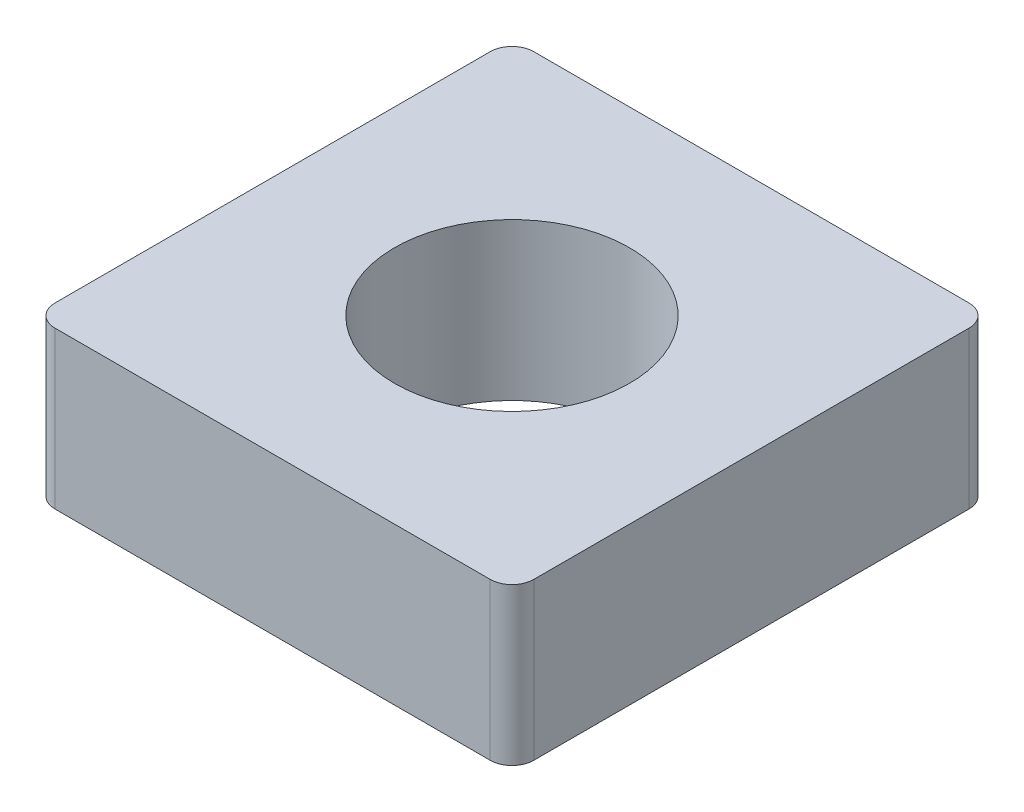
ISO-10303-21;
HEADER;
FILE_DESCRIPTION(('STEP AP214'),'2;1');
FILE_NAME('part.step','',(''),(''),'','','');
FILE_SCHEMA(('AUTOMOTIVE_DESIGN { 1 0 10303 214 1 1 1 1 }'));
ENDSEC;
DATA;
#1=APPLICATION_CONTEXT('core data for automotive mechanical design processes');
#2=APPLICATION_PROTOCOL_DEFINITION('international standard','automotive_design',2000,#1);
#3=PRODUCT_CONTEXT('',#1,'mechanical');
#4=PRODUCT('Part','Part','',(#3));
#5=PRODUCT_RELATED_PRODUCT_CATEGORY('part','',(#4));
#6=PRODUCT_DEFINITION_FORMATION('','',#4);
#7=PRODUCT_DEFINITION_CONTEXT('part definition',#1,'design');
#8=PRODUCT_DEFINITION('design','',#6,#7);
#9=PRODUCT_DEFINITION_SHAPE('','',#8);
#10=(LENGTH_UNIT() NAMED_UNIT(*) SI_UNIT(.MILLI.,.METRE.));
#11=(NAMED_UNIT(*) PLANE_ANGLE_UNIT() SI_UNIT($,.RADIAN.));
#12=(NAMED_UNIT(*) SI_UNIT($,.STERADIAN.) SOLID_ANGLE_UNIT());
#13=UNCERTAINTY_MEASURE_WITH_UNIT(LENGTH_MEASURE(1.E-05),#10,'distance_accuracy_value','');
#14=(GEOMETRIC_REPRESENTATION_CONTEXT(3) GLOBAL_UNCERTAINTY_ASSIGNED_CONTEXT((#13)) GLOBAL_UNIT_ASSIGNED_CONTEXT((#10,
#11,#12)) REPRESENTATION_CONTEXT('',''));
#15=CARTESIAN_POINT('',(0.,0.,0.));
#16=DIRECTION('',(0.,0.,1.));
#17=DIRECTION('',(1.,0.,0.));
#18=AXIS2_PLACEMENT_3D('',#15,#16,#17);
#19=CARTESIAN_POINT('',(0.,1.8,0.));
#20=DIRECTION('',(0.,1.,0.));
#21=DIRECTION('',(0.,0.,1.));
#22=AXIS2_PLACEMENT_3D('',#19,#20,#21);
#23=PLANE('',#22);
#24=DIRECTION('',(-1.,0.,0.));
#25=VECTOR('',#24,1.);
#26=CARTESIAN_POINT('',(2.75,1.8,-2.75));
#27=LINE('',#26,#25);
#28=CARTESIAN_POINT('',(2.5,1.8,-2.75));
#29=VERTEX_POINT('',#28);
#30=CARTESIAN_POINT('',(-2.5,1.8,-2.75));
#31=VERTEX_POINT('',#30);
#32=EDGE_CURVE('E141',#29,#31,#27,.T.);
#33=ORIENTED_EDGE('',*,*,#32,.T.);
#34=CARTESIAN_POINT('',(-2.5,1.8,-2.5));
#35=DIRECTION('',(0.,1.,0.));
#36=DIRECTION('',(0.,0.,1.));
#37=AXIS2_PLACEMENT_3D('',#34,#35,#36);
#38=CIRCLE('',#37,0.25);
#39=CARTESIAN_POINT('',(-2.75,1.8,-2.5));
#40=VERTEX_POINT('',#39);
#41=EDGE_CURVE('E159',#31,#40,#38,.T.);
#42=ORIENTED_EDGE('',*,*,#41,.T.);
#43=DIRECTION('',(0.,0.,1.));
#44=VECTOR('',#43,1.);
#45=CARTESIAN_POINT('',(-2.75,1.8,2.75));
#46=LINE('',#45,#44);
#47=CARTESIAN_POINT('',(-2.75,1.8,2.5));
#48=VERTEX_POINT('',#47);
#49=EDGE_CURVE('E123',#40,#48,#46,.T.);
#50=ORIENTED_EDGE('',*,*,#49,.T.);
#51=CARTESIAN_POINT('',(-2.5,1.8,2.5));
#52=DIRECTION('',(0.,1.,0.));
#53=DIRECTION('',(0.,0.,1.));
#54=AXIS2_PLACEMENT_3D('',#51,#52,#53);
#55=CIRCLE('',#54,0.25);
#56=CARTESIAN_POINT('',(-2.5,1.8,2.75));
#57=VERTEX_POINT('',#56);
#58=EDGE_CURVE('E155',#48,#57,#55,.T.);
#59=ORIENTED_EDGE('',*,*,#58,.T.);
#60=DIRECTION('',(1.,0.,0.));
#61=VECTOR('',#60,1.);
#62=CARTESIAN_POINT('',(2.75,1.8,2.75));
#63=LINE('',#62,#61);
#64=CARTESIAN_POINT('',(2.5,1.8,2.75));
#65=VERTEX_POINT('',#64);
#66=EDGE_CURVE('E168',#57,#65,#63,.T.);
#67=ORIENTED_EDGE('',*,*,#66,.T.);
#68=CARTESIAN_POINT('',(2.5,1.8,2.5));
#69=DIRECTION('',(0.,1.,0.));
#70=DIRECTION('',(0.,0.,1.));
#71=AXIS2_PLACEMENT_3D('',#68,#69,#70);
#72=CIRCLE('',#71,0.25);
#73=CARTESIAN_POINT('',(2.75,1.8,2.5));
#74=VERTEX_POINT('',#73);
#75=EDGE_CURVE('E58',#65,#74,#72,.T.);
#76=ORIENTED_EDGE('',*,*,#75,.T.);
#77=DIRECTION('',(0.,0.,-1.));
#78=VECTOR('',#77,1.);
#79=CARTESIAN_POINT('',(2.75,1.8,2.75));
#80=LINE('',#79,#78);
#81=CARTESIAN_POINT('',(2.75,1.8,-2.5));
#82=VERTEX_POINT('',#81);
#83=EDGE_CURVE('E174',#74,#82,#80,.T.);
#84=ORIENTED_EDGE('',*,*,#83,.T.);
#85=CARTESIAN_POINT('',(2.5,1.8,-2.5));
#86=DIRECTION('',(0.,1.,0.));
#87=DIRECTION('',(0.,0.,1.));
#88=AXIS2_PLACEMENT_3D('',#85,#86,#87);
#89=CIRCLE('',#88,0.25);
#90=EDGE_CURVE('E157',#82,#29,#89,.T.);
#91=ORIENTED_EDGE('',*,*,#90,.T.);
#92=EDGE_LOOP('',(#33,#42,#50,#59,#67,#76,#84,#91));
#93=FACE_BOUND('',#92,.T.);
#94=CARTESIAN_POINT('',(0.,1.8,0.));
#95=DIRECTION('',(0.,1.,0.));
#96=DIRECTION('',(0.,0.,1.));
#97=AXIS2_PLACEMENT_3D('',#94,#95,#96);
#98=CIRCLE('',#97,1.35);
#99=CARTESIAN_POINT('',(0.,1.8,1.35));
#100=VERTEX_POINT('',#99);
#101=EDGE_CURVE('E132',#100,#100,#98,.T.);
#102=ORIENTED_EDGE('',*,*,#101,.F.);
#103=EDGE_LOOP('',(#102));
#104=FACE_BOUND('',#103,.T.);
#105=ADVANCED_FACE('F36',(#93,#104),#23,.T.);
#106=CARTESIAN_POINT('',(0.,0.,0.));
#107=DIRECTION('',(0.,1.,0.));
#108=DIRECTION('',(0.,0.,1.));
#109=AXIS2_PLACEMENT_3D('',#106,#107,#108);
#110=PLANE('',#109);
#111=DIRECTION('',(0.,0.,1.));
#112=VECTOR('',#111,1.);
#113=CARTESIAN_POINT('',(-2.75,0.,2.75));
#114=LINE('',#113,#112);
#115=CARTESIAN_POINT('',(-2.75,0.,-2.5));
#116=VERTEX_POINT('',#115);
#117=CARTESIAN_POINT('',(-2.75,0.,2.5));
#118=VERTEX_POINT('',#117);
#119=EDGE_CURVE('E120',#116,#118,#114,.T.);
#120=ORIENTED_EDGE('',*,*,#119,.F.);
#121=CARTESIAN_POINT('',(-2.5,0.,-2.5));
#122=DIRECTION('',(0.,1.,0.));
#123=DIRECTION('',(0.,0.,1.));
#124=AXIS2_PLACEMENT_3D('',#121,#122,#123);
#125=CIRCLE('',#124,0.25);
#126=CARTESIAN_POINT('',(-2.5,0.,-2.75));
#127=VERTEX_POINT('',#126);
#128=EDGE_CURVE('E103',#116,#127,#125,.F.);
#129=ORIENTED_EDGE('',*,*,#128,.T.);
#130=DIRECTION('',(-1.,0.,0.));
#131=VECTOR('',#130,1.);
#132=CARTESIAN_POINT('',(2.75,0.,-2.75));
#133=LINE('',#132,#131);
#134=CARTESIAN_POINT('',(2.5,0.,-2.75));
#135=VERTEX_POINT('',#134);
#136=EDGE_CURVE('E145',#135,#127,#133,.T.);
#137=ORIENTED_EDGE('',*,*,#136,.F.);
#138=CARTESIAN_POINT('',(2.5,0.,-2.5));
#139=DIRECTION('',(0.,1.,0.));
#140=DIRECTION('',(0.,0.,1.));
#141=AXIS2_PLACEMENT_3D('',#138,#139,#140);
#142=CIRCLE('',#141,0.25);
#143=CARTESIAN_POINT('',(2.75,0.,-2.5));
#144=VERTEX_POINT('',#143);
#145=EDGE_CURVE('E114',#135,#144,#142,.F.);
#146=ORIENTED_EDGE('',*,*,#145,.T.);
#147=DIRECTION('',(0.,0.,-1.));
#148=VECTOR('',#147,1.);
#149=CARTESIAN_POINT('',(2.75,0.,2.75));
#150=LINE('',#149,#148);
#151=CARTESIAN_POINT('',(2.75,0.,2.5));
#152=VERTEX_POINT('',#151);
#153=EDGE_CURVE('E135',#152,#144,#150,.T.);
#154=ORIENTED_EDGE('',*,*,#153,.F.);
#155=CARTESIAN_POINT('',(2.5,0.,2.5));
#156=DIRECTION('',(0.,1.,0.));
#157=DIRECTION('',(0.,0.,1.));
#158=AXIS2_PLACEMENT_3D('',#155,#156,#157);
#159=CIRCLE('',#158,0.25);
#160=CARTESIAN_POINT('',(2.5,0.,2.75));
#161=VERTEX_POINT('',#160);
#162=EDGE_CURVE('E124',#152,#161,#159,.F.);
#163=ORIENTED_EDGE('',*,*,#162,.T.);
#164=DIRECTION('',(1.,0.,0.));
#165=VECTOR('',#164,1.);
#166=CARTESIAN_POINT('',(2.75,0.,2.75));
#167=LINE('',#166,#165);
#168=CARTESIAN_POINT('',(-2.5,0.,2.75));
#169=VERTEX_POINT('',#168);
#170=EDGE_CURVE('E131',#169,#161,#167,.T.);
#171=ORIENTED_EDGE('',*,*,#170,.F.);
#172=CARTESIAN_POINT('',(-2.5,0.,2.5));
#173=DIRECTION('',(0.,1.,0.));
#174=DIRECTION('',(0.,0.,1.));
#175=AXIS2_PLACEMENT_3D('',#172,#173,#174);
#176=CIRCLE('',#175,0.25);
#177=EDGE_CURVE('E130',#169,#118,#176,.F.);
#178=ORIENTED_EDGE('',*,*,#177,.T.);
#179=EDGE_LOOP('',(#120,#129,#137,#146,#154,#163,#171,#178));
#180=FACE_BOUND('',#179,.T.);
#181=CARTESIAN_POINT('',(0.,0.,0.));
#182=DIRECTION('',(0.,1.,0.));
#183=DIRECTION('',(0.,0.,1.));
#184=AXIS2_PLACEMENT_3D('',#181,#182,#183);
#185=CIRCLE('',#184,1.35);
#186=CARTESIAN_POINT('',(0.,0.,1.35));
#187=VERTEX_POINT('',#186);
#188=EDGE_CURVE('E138',#187,#187,#185,.T.);
#189=ORIENTED_EDGE('',*,*,#188,.T.);
#190=EDGE_LOOP('',(#189));
#191=FACE_BOUND('',#190,.T.);
#192=ADVANCED_FACE('F127',(#180,#191),#110,.F.);
#193=CARTESIAN_POINT('',(-2.75,1.8,2.75));
#194=DIRECTION('',(1.,0.,0.));
#195=DIRECTION('',(0.,0.,-1.));
#196=AXIS2_PLACEMENT_3D('',#193,#194,#195);
#197=PLANE('',#196);
#198=ORIENTED_EDGE('',*,*,#49,.F.);
#199=DIRECTION('',(0.,-1.,0.));
#200=VECTOR('',#199,1.);
#201=CARTESIAN_POINT('',(-2.75,1.8,-2.5));
#202=LINE('',#201,#200);
#203=EDGE_CURVE('E107',#40,#116,#202,.T.);
#204=ORIENTED_EDGE('',*,*,#203,.T.);
#205=ORIENTED_EDGE('',*,*,#119,.T.);
#206=DIRECTION('',(0.,-1.,0.));
#207=VECTOR('',#206,1.);
#208=CARTESIAN_POINT('',(-2.75,1.8,2.5));
#209=LINE('',#208,#207);
#210=EDGE_CURVE('E125',#118,#48,#209,.F.);
#211=ORIENTED_EDGE('',*,*,#210,.T.);
#212=EDGE_LOOP('',(#198,#204,#205,#211));
#213=FACE_BOUND('',#212,.T.);
#214=ADVANCED_FACE('F119',(#213),#197,.F.);
#215=CARTESIAN_POINT('',(2.75,1.8,2.75));
#216=DIRECTION('',(0.,0.,-1.));
#217=DIRECTION('',(-1.,0.,0.));
#218=AXIS2_PLACEMENT_3D('',#215,#216,#217);
#219=PLANE('',#218);
#220=ORIENTED_EDGE('',*,*,#66,.F.);
#221=DIRECTION('',(0.,-1.,0.));
#222=VECTOR('',#221,1.);
#223=CARTESIAN_POINT('',(-2.5,1.8,2.75));
#224=LINE('',#223,#222);
#225=EDGE_CURVE('E11',#57,#169,#224,.T.);
#226=ORIENTED_EDGE('',*,*,#225,.T.);
#227=ORIENTED_EDGE('',*,*,#170,.T.);
#228=DIRECTION('',(0.,-1.,0.));
#229=VECTOR('',#228,1.);
#230=CARTESIAN_POINT('',(2.5,1.8,2.75));
#231=LINE('',#230,#229);
#232=EDGE_CURVE('E44',#161,#65,#231,.F.);
#233=ORIENTED_EDGE('',*,*,#232,.T.);
#234=EDGE_LOOP('',(#220,#226,#227,#233));
#235=FACE_BOUND('',#234,.T.);
#236=ADVANCED_FACE('F167',(#235),#219,.F.);
#237=CARTESIAN_POINT('',(2.75,1.8,2.75));
#238=DIRECTION('',(-1.,0.,0.));
#239=DIRECTION('',(0.,0.,1.));
#240=AXIS2_PLACEMENT_3D('',#237,#238,#239);
#241=PLANE('',#240);
#242=ORIENTED_EDGE('',*,*,#153,.T.);
#243=DIRECTION('',(0.,-1.,0.));
#244=VECTOR('',#243,1.);
#245=CARTESIAN_POINT('',(2.75,1.8,-2.5));
#246=LINE('',#245,#244);
#247=EDGE_CURVE('E51',#144,#82,#246,.F.);
#248=ORIENTED_EDGE('',*,*,#247,.T.);
#249=ORIENTED_EDGE('',*,*,#83,.F.);
#250=DIRECTION('',(0.,-1.,0.));
#251=VECTOR('',#250,1.);
#252=CARTESIAN_POINT('',(2.75,1.8,2.5));
#253=LINE('',#252,#251);
#254=EDGE_CURVE('E161',#74,#152,#253,.T.);
#255=ORIENTED_EDGE('',*,*,#254,.T.);
#256=EDGE_LOOP('',(#242,#248,#249,#255));
#257=FACE_BOUND('',#256,.T.);
#258=ADVANCED_FACE('F178',(#257),#241,.F.);
#259=CARTESIAN_POINT('',(2.75,1.8,-2.75));
#260=DIRECTION('',(0.,0.,1.));
#261=DIRECTION('',(1.,0.,0.));
#262=AXIS2_PLACEMENT_3D('',#259,#260,#261);
#263=PLANE('',#262);
#264=ORIENTED_EDGE('',*,*,#136,.T.);
#265=DIRECTION('',(0.,-1.,0.));
#266=VECTOR('',#265,1.);
#267=CARTESIAN_POINT('',(-2.5,1.8,-2.75));
#268=LINE('',#267,#266);
#269=EDGE_CURVE('E108',#127,#31,#268,.F.);
#270=ORIENTED_EDGE('',*,*,#269,.T.);
#271=ORIENTED_EDGE('',*,*,#32,.F.);
#272=DIRECTION('',(0.,-1.,0.));
#273=VECTOR('',#272,1.);
#274=CARTESIAN_POINT('',(2.5,1.8,-2.75));
#275=LINE('',#274,#273);
#276=EDGE_CURVE('E113',#29,#135,#275,.T.);
#277=ORIENTED_EDGE('',*,*,#276,.T.);
#278=EDGE_LOOP('',(#264,#270,#271,#277));
#279=FACE_BOUND('',#278,.T.);
#280=ADVANCED_FACE('F185',(#279),#263,.F.);
#281=CARTESIAN_POINT('',(0.,1.8,0.));
#282=DIRECTION('',(0.,-1.,0.));
#283=DIRECTION('',(0.,0.,-1.));
#284=AXIS2_PLACEMENT_3D('',#281,#282,#283);
#285=CYLINDRICAL_SURFACE('',#284,1.35);
#286=ORIENTED_EDGE('',*,*,#101,.T.);
#287=EDGE_LOOP('',(#286));
#288=FACE_BOUND('',#287,.T.);
#289=ORIENTED_EDGE('',*,*,#188,.F.);
#290=EDGE_LOOP('',(#289));
#291=FACE_BOUND('',#290,.T.);
#292=ADVANCED_FACE('F191',(#288,#291),#285,.F.);
#293=CARTESIAN_POINT('',(-2.5,1.8,-2.5));
#294=DIRECTION('',(0.,-1.,0.));
#295=DIRECTION('',(0.,0.,-1.));
#296=AXIS2_PLACEMENT_3D('',#293,#294,#295);
#297=CYLINDRICAL_SURFACE('',#296,0.25);
#298=ORIENTED_EDGE('',*,*,#41,.F.);
#299=ORIENTED_EDGE('',*,*,#269,.F.);
#300=ORIENTED_EDGE('',*,*,#128,.F.);
#301=ORIENTED_EDGE('',*,*,#203,.F.);
#302=EDGE_LOOP('',(#298,#299,#300,#301));
#303=FACE_BOUND('',#302,.T.);
#304=ADVANCED_FACE('F106',(#303),#297,.T.);
#305=CARTESIAN_POINT('',(2.5,1.8,-2.5));
#306=DIRECTION('',(0.,-1.,0.));
#307=DIRECTION('',(0.,0.,-1.));
#308=AXIS2_PLACEMENT_3D('',#305,#306,#307);
#309=CYLINDRICAL_SURFACE('',#308,0.25);
#310=ORIENTED_EDGE('',*,*,#90,.F.);
#311=ORIENTED_EDGE('',*,*,#247,.F.);
#312=ORIENTED_EDGE('',*,*,#145,.F.);
#313=ORIENTED_EDGE('',*,*,#276,.F.);
#314=EDGE_LOOP('',(#310,#311,#312,#313));
#315=FACE_BOUND('',#314,.T.);
#316=ADVANCED_FACE('F182',(#315),#309,.T.);
#317=CARTESIAN_POINT('',(-2.5,1.8,2.5));
#318=DIRECTION('',(0.,-1.,0.));
#319=DIRECTION('',(0.,0.,-1.));
#320=AXIS2_PLACEMENT_3D('',#317,#318,#319);
#321=CYLINDRICAL_SURFACE('',#320,0.25);
#322=ORIENTED_EDGE('',*,*,#58,.F.);
#323=ORIENTED_EDGE('',*,*,#210,.F.);
#324=ORIENTED_EDGE('',*,*,#177,.F.);
#325=ORIENTED_EDGE('',*,*,#225,.F.);
#326=EDGE_LOOP('',(#322,#323,#324,#325));
#327=FACE_BOUND('',#326,.T.);
#328=ADVANCED_FACE('F215',(#327),#321,.T.);
#329=CARTESIAN_POINT('',(2.5,1.8,2.5));
#330=DIRECTION('',(0.,-1.,0.));
#331=DIRECTION('',(0.,0.,-1.));
#332=AXIS2_PLACEMENT_3D('',#329,#330,#331);
#333=CYLINDRICAL_SURFACE('',#332,0.25);
#334=ORIENTED_EDGE('',*,*,#75,.F.);
#335=ORIENTED_EDGE('',*,*,#232,.F.);
#336=ORIENTED_EDGE('',*,*,#162,.F.);
#337=ORIENTED_EDGE('',*,*,#254,.F.);
#338=EDGE_LOOP('',(#334,#335,#336,#337));
#339=FACE_BOUND('',#338,.T.);
#340=ADVANCED_FACE('F38',(#339),#333,.T.);
#341=CLOSED_SHELL('',(#105,#192,#214,#236,#258,#280,#292,#304,#316,#328,#340));
#342=MANIFOLD_SOLID_BREP('B2',#341);
#343=ADVANCED_BREP_SHAPE_REPRESENTATION('',(#18,#342),#14);
#344=SHAPE_DEFINITION_REPRESENTATION(#9,#343);
ENDSEC;
END-ISO-10303-21;
